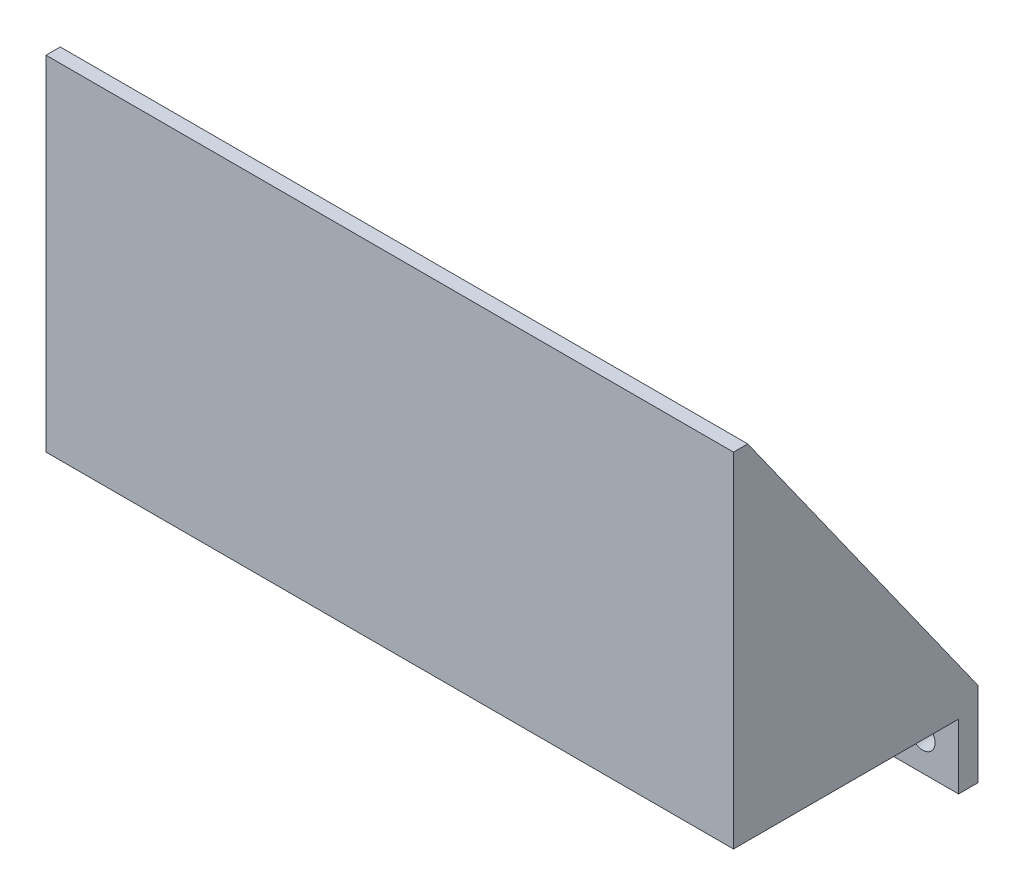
ISO-10303-21;
HEADER;
FILE_DESCRIPTION(('STEP AP214'),'2;1');
FILE_NAME('part.step','',(''),(''),'','','');
FILE_SCHEMA(('AUTOMOTIVE_DESIGN { 1 0 10303 214 1 1 1 1 }'));
ENDSEC;
DATA;
#1=APPLICATION_CONTEXT('core data for automotive mechanical design processes');
#2=APPLICATION_PROTOCOL_DEFINITION('international standard','automotive_design',2000,#1);
#3=PRODUCT_CONTEXT('',#1,'mechanical');
#4=PRODUCT('Part','Part','',(#3));
#5=PRODUCT_RELATED_PRODUCT_CATEGORY('part','',(#4));
#6=PRODUCT_DEFINITION_FORMATION('','',#4);
#7=PRODUCT_DEFINITION_CONTEXT('part definition',#1,'design');
#8=PRODUCT_DEFINITION('design','',#6,#7);
#9=PRODUCT_DEFINITION_SHAPE('','',#8);
#10=(LENGTH_UNIT() NAMED_UNIT(*) SI_UNIT(.MILLI.,.METRE.));
#11=(NAMED_UNIT(*) PLANE_ANGLE_UNIT() SI_UNIT($,.RADIAN.));
#12=(NAMED_UNIT(*) SI_UNIT($,.STERADIAN.) SOLID_ANGLE_UNIT());
#13=UNCERTAINTY_MEASURE_WITH_UNIT(LENGTH_MEASURE(1.E-05),#10,'distance_accuracy_value','');
#14=(GEOMETRIC_REPRESENTATION_CONTEXT(3) GLOBAL_UNCERTAINTY_ASSIGNED_CONTEXT((#13)) GLOBAL_UNIT_ASSIGNED_CONTEXT((#10,
#11,#12)) REPRESENTATION_CONTEXT('',''));
#15=CARTESIAN_POINT('',(0.,0.,0.));
#16=DIRECTION('',(0.,0.,1.));
#17=DIRECTION('',(1.,0.,0.));
#18=AXIS2_PLACEMENT_3D('',#15,#16,#17);
#19=CARTESIAN_POINT('',(-3.,50.,0.));
#20=DIRECTION('',(1.,0.,0.));
#21=DIRECTION('',(0.,0.,-1.));
#22=AXIS2_PLACEMENT_3D('',#19,#20,#21);
#23=PLANE('',#22);
#24=DIRECTION('',(0.,0.815382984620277,0.578921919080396));
#25=VECTOR('',#24,1.);
#26=CARTESIAN_POINT('',(-3.,50.,0.));
#27=LINE('',#26,#25);
#28=CARTESIAN_POINT('',(-3.,0.,-35.5));
#29=VERTEX_POINT('',#28);
#30=CARTESIAN_POINT('',(-3.,50.,0.));
#31=VERTEX_POINT('',#30);
#32=EDGE_CURVE('E80',#29,#31,#27,.T.);
#33=ORIENTED_EDGE('',*,*,#32,.F.);
#34=DIRECTION('',(0.,1.,0.));
#35=VECTOR('',#34,1.);
#36=CARTESIAN_POINT('',(-3.,-13.,-35.5));
#37=LINE('',#36,#35);
#38=CARTESIAN_POINT('',(-3.,-13.,-35.5));
#39=VERTEX_POINT('',#38);
#40=EDGE_CURVE('E125',#39,#29,#37,.T.);
#41=ORIENTED_EDGE('',*,*,#40,.F.);
#42=DIRECTION('',(0.,0.,1.));
#43=VECTOR('',#42,1.);
#44=CARTESIAN_POINT('',(-3.,-13.,0.));
#45=LINE('',#44,#43);
#46=CARTESIAN_POINT('',(-3.,-13.,-32.5));
#47=VERTEX_POINT('',#46);
#48=EDGE_CURVE('E129',#39,#47,#45,.T.);
#49=ORIENTED_EDGE('',*,*,#48,.T.);
#50=DIRECTION('',(0.,1.,0.));
#51=VECTOR('',#50,1.);
#52=CARTESIAN_POINT('',(-3.,-13.,-32.5));
#53=LINE('',#52,#51);
#54=CARTESIAN_POINT('',(-3.,-3.,-32.5));
#55=VERTEX_POINT('',#54);
#56=EDGE_CURVE('E133',#47,#55,#53,.T.);
#57=ORIENTED_EDGE('',*,*,#56,.T.);
#58=DIRECTION('',(0.,0.,1.));
#59=VECTOR('',#58,1.);
#60=CARTESIAN_POINT('',(-3.,-3.,0.));
#61=LINE('',#60,#59);
#62=CARTESIAN_POINT('',(-3.,-3.,2.19738026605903));
#63=VERTEX_POINT('',#62);
#64=EDGE_CURVE('E164',#55,#63,#61,.T.);
#65=ORIENTED_EDGE('',*,*,#64,.T.);
#66=DIRECTION('',(0.,-1.,0.));
#67=VECTOR('',#66,1.);
#68=CARTESIAN_POINT('',(-3.,50.,2.19738026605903));
#69=LINE('',#68,#67);
#70=CARTESIAN_POINT('',(-3.,50.,2.19738026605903));
#71=VERTEX_POINT('',#70);
#72=EDGE_CURVE('E11',#71,#63,#69,.T.);
#73=ORIENTED_EDGE('',*,*,#72,.F.);
#74=DIRECTION('',(0.,0.,1.));
#75=VECTOR('',#74,1.);
#76=CARTESIAN_POINT('',(-3.,50.,0.));
#77=LINE('',#76,#75);
#78=EDGE_CURVE('E185',#31,#71,#77,.T.);
#79=ORIENTED_EDGE('',*,*,#78,.F.);
#80=EDGE_LOOP('',(#33,#41,#49,#57,#65,#73,#79));
#81=FACE_BOUND('',#80,.T.);
#82=ADVANCED_FACE('F41',(#81),#23,.F.);
#83=CARTESIAN_POINT('',(103.,50.,0.));
#84=DIRECTION('',(1.,0.,0.));
#85=DIRECTION('',(0.,0.,-1.));
#86=AXIS2_PLACEMENT_3D('',#83,#84,#85);
#87=PLANE('',#86);
#88=DIRECTION('',(0.,1.,0.));
#89=VECTOR('',#88,1.);
#90=CARTESIAN_POINT('',(103.,-13.,-35.5));
#91=LINE('',#90,#89);
#92=CARTESIAN_POINT('',(103.,-13.,-35.5));
#93=VERTEX_POINT('',#92);
#94=CARTESIAN_POINT('',(103.,0.,-35.5));
#95=VERTEX_POINT('',#94);
#96=EDGE_CURVE('E141',#93,#95,#91,.T.);
#97=ORIENTED_EDGE('',*,*,#96,.T.);
#98=DIRECTION('',(0.,0.815382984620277,0.578921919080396));
#99=VECTOR('',#98,1.);
#100=CARTESIAN_POINT('',(103.,50.,0.));
#101=LINE('',#100,#99);
#102=CARTESIAN_POINT('',(103.,50.,0.));
#103=VERTEX_POINT('',#102);
#104=EDGE_CURVE('E182',#95,#103,#101,.T.);
#105=ORIENTED_EDGE('',*,*,#104,.T.);
#106=DIRECTION('',(0.,0.,1.));
#107=VECTOR('',#106,1.);
#108=CARTESIAN_POINT('',(103.,50.,0.));
#109=LINE('',#108,#107);
#110=CARTESIAN_POINT('',(103.,50.,2.19738026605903));
#111=VERTEX_POINT('',#110);
#112=EDGE_CURVE('E59',#103,#111,#109,.T.);
#113=ORIENTED_EDGE('',*,*,#112,.T.);
#114=DIRECTION('',(0.,-1.,0.));
#115=VECTOR('',#114,1.);
#116=CARTESIAN_POINT('',(103.,50.,2.19738026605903));
#117=LINE('',#116,#115);
#118=CARTESIAN_POINT('',(103.,-3.,2.19738026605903));
#119=VERTEX_POINT('',#118);
#120=EDGE_CURVE('E50',#111,#119,#117,.T.);
#121=ORIENTED_EDGE('',*,*,#120,.T.);
#122=DIRECTION('',(0.,0.,1.));
#123=VECTOR('',#122,1.);
#124=CARTESIAN_POINT('',(103.,-3.,0.));
#125=LINE('',#124,#123);
#126=CARTESIAN_POINT('',(103.,-3.,-32.5));
#127=VERTEX_POINT('',#126);
#128=EDGE_CURVE('E170',#127,#119,#125,.T.);
#129=ORIENTED_EDGE('',*,*,#128,.F.);
#130=DIRECTION('',(0.,1.,0.));
#131=VECTOR('',#130,1.);
#132=CARTESIAN_POINT('',(103.,-13.,-32.5));
#133=LINE('',#132,#131);
#134=CARTESIAN_POINT('',(103.,-13.,-32.5));
#135=VERTEX_POINT('',#134);
#136=EDGE_CURVE('E159',#135,#127,#133,.T.);
#137=ORIENTED_EDGE('',*,*,#136,.F.);
#138=DIRECTION('',(0.,0.,1.));
#139=VECTOR('',#138,1.);
#140=CARTESIAN_POINT('',(103.,-13.,0.));
#141=LINE('',#140,#139);
#142=EDGE_CURVE('E134',#93,#135,#141,.T.);
#143=ORIENTED_EDGE('',*,*,#142,.F.);
#144=EDGE_LOOP('',(#97,#105,#113,#121,#129,#137,#143));
#145=FACE_BOUND('',#144,.T.);
#146=ADVANCED_FACE('F207',(#145),#87,.T.);
#147=CARTESIAN_POINT('',(100.5,50.,0.));
#148=DIRECTION('',(-1.,0.,0.));
#149=DIRECTION('',(0.,0.,1.));
#150=AXIS2_PLACEMENT_3D('',#147,#148,#149);
#151=PLANE('',#150);
#152=DIRECTION('',(0.,-1.,0.));
#153=VECTOR('',#152,1.);
#154=CARTESIAN_POINT('',(100.5,50.,0.));
#155=LINE('',#154,#153);
#156=CARTESIAN_POINT('',(100.5,50.,0.));
#157=VERTEX_POINT('',#156);
#158=CARTESIAN_POINT('',(100.5,0.,0.));
#159=VERTEX_POINT('',#158);
#160=EDGE_CURVE('E71',#157,#159,#155,.T.);
#161=ORIENTED_EDGE('',*,*,#160,.F.);
#162=DIRECTION('',(0.,-0.815382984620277,-0.578921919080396));
#163=VECTOR('',#162,1.);
#164=CARTESIAN_POINT('',(100.5,50.,0.));
#165=LINE('',#164,#163);
#166=CARTESIAN_POINT('',(100.5,0.,-35.5));
#167=VERTEX_POINT('',#166);
#168=EDGE_CURVE('E179',#157,#167,#165,.T.);
#169=ORIENTED_EDGE('',*,*,#168,.T.);
#170=DIRECTION('',(0.,0.,-1.));
#171=VECTOR('',#170,1.);
#172=CARTESIAN_POINT('',(100.5,0.,0.));
#173=LINE('',#172,#171);
#174=EDGE_CURVE('E194',#159,#167,#173,.T.);
#175=ORIENTED_EDGE('',*,*,#174,.F.);
#176=EDGE_LOOP('',(#161,#169,#175));
#177=FACE_BOUND('',#176,.T.);
#178=ADVANCED_FACE('F215',(#177),#151,.T.);
#179=CARTESIAN_POINT('',(0.,50.,0.));
#180=DIRECTION('',(-1.,0.,0.));
#181=DIRECTION('',(0.,0.,1.));
#182=AXIS2_PLACEMENT_3D('',#179,#180,#181);
#183=PLANE('',#182);
#184=DIRECTION('',(0.,-0.815382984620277,-0.578921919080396));
#185=VECTOR('',#184,1.);
#186=CARTESIAN_POINT('',(0.,50.,0.));
#187=LINE('',#186,#185);
#188=CARTESIAN_POINT('',(0.,50.,0.));
#189=VERTEX_POINT('',#188);
#190=CARTESIAN_POINT('',(0.,0.,-35.5));
#191=VERTEX_POINT('',#190);
#192=EDGE_CURVE('E176',#189,#191,#187,.T.);
#193=ORIENTED_EDGE('',*,*,#192,.F.);
#194=DIRECTION('',(0.,-1.,0.));
#195=VECTOR('',#194,1.);
#196=CARTESIAN_POINT('',(0.,50.,0.));
#197=LINE('',#196,#195);
#198=CARTESIAN_POINT('',(0.,0.,0.));
#199=VERTEX_POINT('',#198);
#200=EDGE_CURVE('E193',#189,#199,#197,.T.);
#201=ORIENTED_EDGE('',*,*,#200,.T.);
#202=DIRECTION('',(0.,0.,-1.));
#203=VECTOR('',#202,1.);
#204=CARTESIAN_POINT('',(0.,0.,0.));
#205=LINE('',#204,#203);
#206=EDGE_CURVE('E188',#199,#191,#205,.T.);
#207=ORIENTED_EDGE('',*,*,#206,.T.);
#208=EDGE_LOOP('',(#193,#201,#207));
#209=FACE_BOUND('',#208,.T.);
#210=ADVANCED_FACE('F221',(#209),#183,.F.);
#211=CARTESIAN_POINT('',(0.,50.,0.));
#212=DIRECTION('',(0.,1.,0.));
#213=DIRECTION('',(0.,0.,1.));
#214=AXIS2_PLACEMENT_3D('',#211,#212,#213);
#215=PLANE('',#214);
#216=ORIENTED_EDGE('',*,*,#112,.F.);
#217=DIRECTION('',(-1.,0.,0.));
#218=VECTOR('',#217,1.);
#219=CARTESIAN_POINT('',(110.,50.,0.));
#220=LINE('',#219,#218);
#221=EDGE_CURVE('E175',#103,#157,#220,.T.);
#222=ORIENTED_EDGE('',*,*,#221,.T.);
#223=DIRECTION('',(1.,0.,0.));
#224=VECTOR('',#223,1.);
#225=CARTESIAN_POINT('',(0.,50.,0.));
#226=LINE('',#225,#224);
#227=EDGE_CURVE('E191',#189,#157,#226,.T.);
#228=ORIENTED_EDGE('',*,*,#227,.F.);
#229=EDGE_CURVE('E173',#189,#31,#220,.T.);
#230=ORIENTED_EDGE('',*,*,#229,.T.);
#231=ORIENTED_EDGE('',*,*,#78,.T.);
#232=DIRECTION('',(1.,0.,0.));
#233=VECTOR('',#232,1.);
#234=CARTESIAN_POINT('',(0.,50.,2.19738026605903));
#235=LINE('',#234,#233);
#236=EDGE_CURVE('E187',#71,#111,#235,.T.);
#237=ORIENTED_EDGE('',*,*,#236,.T.);
#238=EDGE_LOOP('',(#216,#222,#228,#230,#231,#237));
#239=FACE_BOUND('',#238,.T.);
#240=ADVANCED_FACE('F213',(#239),#215,.T.);
#241=CARTESIAN_POINT('',(0.,50.,2.19738026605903));
#242=DIRECTION('',(0.,0.,-1.));
#243=DIRECTION('',(-1.,0.,0.));
#244=AXIS2_PLACEMENT_3D('',#241,#242,#243);
#245=PLANE('',#244);
#246=ORIENTED_EDGE('',*,*,#72,.T.);
#247=DIRECTION('',(1.,0.,0.));
#248=VECTOR('',#247,1.);
#249=CARTESIAN_POINT('',(0.,-3.,2.19738026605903));
#250=LINE('',#249,#248);
#251=EDGE_CURVE('E167',#63,#119,#250,.T.);
#252=ORIENTED_EDGE('',*,*,#251,.T.);
#253=ORIENTED_EDGE('',*,*,#120,.F.);
#254=ORIENTED_EDGE('',*,*,#236,.F.);
#255=EDGE_LOOP('',(#246,#252,#253,#254));
#256=FACE_BOUND('',#255,.T.);
#257=ADVANCED_FACE('F229',(#256),#245,.F.);
#258=CARTESIAN_POINT('',(0.,50.,0.));
#259=DIRECTION('',(0.,0.,-1.));
#260=DIRECTION('',(-1.,0.,0.));
#261=AXIS2_PLACEMENT_3D('',#258,#259,#260);
#262=PLANE('',#261);
#263=DIRECTION('',(1.,0.,0.));
#264=VECTOR('',#263,1.);
#265=CARTESIAN_POINT('',(0.,0.,0.));
#266=LINE('',#265,#264);
#267=EDGE_CURVE('E196',#199,#159,#266,.T.);
#268=ORIENTED_EDGE('',*,*,#267,.F.);
#269=ORIENTED_EDGE('',*,*,#200,.F.);
#270=ORIENTED_EDGE('',*,*,#227,.T.);
#271=ORIENTED_EDGE('',*,*,#160,.T.);
#272=EDGE_LOOP('',(#268,#269,#270,#271));
#273=FACE_BOUND('',#272,.T.);
#274=ADVANCED_FACE('F217',(#273),#262,.T.);
#275=CARTESIAN_POINT('',(110.,0.,-35.5));
#276=DIRECTION('',(0.,0.578921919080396,-0.815382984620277));
#277=DIRECTION('',(0.,0.815382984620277,0.578921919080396));
#278=AXIS2_PLACEMENT_3D('',#275,#276,#277);
#279=PLANE('',#278);
#280=ORIENTED_EDGE('',*,*,#32,.T.);
#281=ORIENTED_EDGE('',*,*,#229,.F.);
#282=ORIENTED_EDGE('',*,*,#192,.T.);
#283=DIRECTION('',(-1.,0.,0.));
#284=VECTOR('',#283,1.);
#285=CARTESIAN_POINT('',(0.,0.,-35.5));
#286=LINE('',#285,#284);
#287=EDGE_CURVE('E197',#191,#29,#286,.T.);
#288=ORIENTED_EDGE('',*,*,#287,.T.);
#289=EDGE_LOOP('',(#280,#281,#282,#288));
#290=FACE_BOUND('',#289,.T.);
#291=ADVANCED_FACE('F222',(#290),#279,.T.);
#292=DIRECTION('',(1.,0.,0.));
#293=VECTOR('',#292,1.);
#294=CARTESIAN_POINT('',(100.5,0.,-35.5));
#295=LINE('',#294,#293);
#296=EDGE_CURVE('E44',#167,#95,#295,.T.);
#297=ORIENTED_EDGE('',*,*,#296,.F.);
#298=ORIENTED_EDGE('',*,*,#168,.F.);
#299=ORIENTED_EDGE('',*,*,#221,.F.);
#300=ORIENTED_EDGE('',*,*,#104,.F.);
#301=EDGE_LOOP('',(#297,#298,#299,#300));
#302=FACE_BOUND('',#301,.T.);
#303=ADVANCED_FACE('F209',(#302),#279,.T.);
#304=CARTESIAN_POINT('',(0.,0.,0.));
#305=DIRECTION('',(0.,1.,0.));
#306=DIRECTION('',(0.,0.,1.));
#307=AXIS2_PLACEMENT_3D('',#304,#305,#306);
#308=PLANE('',#307);
#309=ORIENTED_EDGE('',*,*,#206,.F.);
#310=ORIENTED_EDGE('',*,*,#267,.T.);
#311=ORIENTED_EDGE('',*,*,#174,.T.);
#312=DIRECTION('',(1.,0.,0.));
#313=VECTOR('',#312,1.);
#314=CARTESIAN_POINT('',(0.,0.,-35.5));
#315=LINE('',#314,#313);
#316=EDGE_CURVE('E143',#191,#167,#315,.T.);
#317=ORIENTED_EDGE('',*,*,#316,.F.);
#318=EDGE_LOOP('',(#309,#310,#311,#317));
#319=FACE_BOUND('',#318,.T.);
#320=ADVANCED_FACE('F244',(#319),#308,.T.);
#321=CARTESIAN_POINT('',(0.,-3.,0.));
#322=DIRECTION('',(0.,1.,0.));
#323=DIRECTION('',(0.,0.,1.));
#324=AXIS2_PLACEMENT_3D('',#321,#322,#323);
#325=PLANE('',#324);
#326=DIRECTION('',(1.,0.,0.));
#327=VECTOR('',#326,1.);
#328=CARTESIAN_POINT('',(0.,-3.,-32.5));
#329=LINE('',#328,#327);
#330=EDGE_CURVE('E158',#55,#127,#329,.T.);
#331=ORIENTED_EDGE('',*,*,#330,.T.);
#332=ORIENTED_EDGE('',*,*,#128,.T.);
#333=ORIENTED_EDGE('',*,*,#251,.F.);
#334=ORIENTED_EDGE('',*,*,#64,.F.);
#335=EDGE_LOOP('',(#331,#332,#333,#334));
#336=FACE_BOUND('',#335,.T.);
#337=ADVANCED_FACE('F232',(#336),#325,.F.);
#338=CARTESIAN_POINT('',(0.,-13.,-32.5));
#339=DIRECTION('',(0.,0.,1.));
#340=DIRECTION('',(1.,0.,0.));
#341=AXIS2_PLACEMENT_3D('',#338,#339,#340);
#342=PLANE('',#341);
#343=CARTESIAN_POINT('',(2.51427855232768,-8.,-32.5));
#344=DIRECTION('',(0.,0.,1.));
#345=DIRECTION('',(1.,0.,0.));
#346=AXIS2_PLACEMENT_3D('',#343,#344,#345);
#347=CIRCLE('',#346,1.9);
#348=CARTESIAN_POINT('',(4.41427855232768,-8.,-32.5));
#349=VERTEX_POINT('',#348);
#350=EDGE_CURVE('E496',#349,#349,#347,.T.);
#351=ORIENTED_EDGE('',*,*,#350,.F.);
#352=EDGE_LOOP('',(#351));
#353=FACE_BOUND('',#352,.T.);
#354=CARTESIAN_POINT('',(97.4857214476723,-8.,-32.5));
#355=DIRECTION('',(0.,0.,1.));
#356=DIRECTION('',(-1.,0.,0.));
#357=AXIS2_PLACEMENT_3D('',#354,#355,#356);
#358=CIRCLE('',#357,1.9);
#359=CARTESIAN_POINT('',(95.5857214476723,-8.,-32.5));
#360=VERTEX_POINT('',#359);
#361=EDGE_CURVE('E497',#360,#360,#358,.T.);
#362=ORIENTED_EDGE('',*,*,#361,.F.);
#363=EDGE_LOOP('',(#362));
#364=FACE_BOUND('',#363,.T.);
#365=ORIENTED_EDGE('',*,*,#330,.F.);
#366=ORIENTED_EDGE('',*,*,#56,.F.);
#367=DIRECTION('',(1.,0.,0.));
#368=VECTOR('',#367,1.);
#369=CARTESIAN_POINT('',(0.,-13.,-32.5));
#370=LINE('',#369,#368);
#371=EDGE_CURVE('E148',#47,#135,#370,.T.);
#372=ORIENTED_EDGE('',*,*,#371,.T.);
#373=ORIENTED_EDGE('',*,*,#136,.T.);
#374=EDGE_LOOP('',(#365,#366,#372,#373));
#375=FACE_BOUND('',#374,.T.);
#376=ADVANCED_FACE('F234',(#353,#364,#375),#342,.T.);
#377=CARTESIAN_POINT('',(0.,-13.,-35.5));
#378=DIRECTION('',(0.,0.,1.));
#379=DIRECTION('',(1.,0.,0.));
#380=AXIS2_PLACEMENT_3D('',#377,#378,#379);
#381=PLANE('',#380);
#382=CARTESIAN_POINT('',(2.51427855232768,-8.,-35.5));
#383=DIRECTION('',(0.,0.,1.));
#384=DIRECTION('',(1.,0.,0.));
#385=AXIS2_PLACEMENT_3D('',#382,#383,#384);
#386=CIRCLE('',#385,1.9);
#387=CARTESIAN_POINT('',(4.41427855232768,-8.,-35.5));
#388=VERTEX_POINT('',#387);
#389=EDGE_CURVE('E156',#388,#388,#386,.F.);
#390=ORIENTED_EDGE('',*,*,#389,.F.);
#391=EDGE_LOOP('',(#390));
#392=FACE_BOUND('',#391,.T.);
#393=CARTESIAN_POINT('',(97.4857214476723,-8.,-35.5));
#394=DIRECTION('',(0.,0.,1.));
#395=DIRECTION('',(1.,0.,0.));
#396=AXIS2_PLACEMENT_3D('',#393,#394,#395);
#397=CIRCLE('',#396,1.9);
#398=CARTESIAN_POINT('',(99.3857214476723,-8.,-35.5));
#399=VERTEX_POINT('',#398);
#400=EDGE_CURVE('E501',#399,#399,#397,.F.);
#401=ORIENTED_EDGE('',*,*,#400,.F.);
#402=EDGE_LOOP('',(#401));
#403=FACE_BOUND('',#402,.T.);
#404=ORIENTED_EDGE('',*,*,#287,.F.);
#405=ORIENTED_EDGE('',*,*,#316,.T.);
#406=ORIENTED_EDGE('',*,*,#296,.T.);
#407=ORIENTED_EDGE('',*,*,#96,.F.);
#408=DIRECTION('',(1.,0.,0.));
#409=VECTOR('',#408,1.);
#410=CARTESIAN_POINT('',(0.,-13.,-35.5));
#411=LINE('',#410,#409);
#412=EDGE_CURVE('E138',#39,#93,#411,.T.);
#413=ORIENTED_EDGE('',*,*,#412,.F.);
#414=ORIENTED_EDGE('',*,*,#40,.T.);
#415=EDGE_LOOP('',(#404,#405,#406,#407,#413,#414));
#416=FACE_BOUND('',#415,.T.);
#417=ADVANCED_FACE('F139',(#392,#403,#416),#381,.F.);
#418=CARTESIAN_POINT('',(0.,-13.,0.));
#419=DIRECTION('',(0.,1.,0.));
#420=DIRECTION('',(0.,0.,1.));
#421=AXIS2_PLACEMENT_3D('',#418,#419,#420);
#422=PLANE('',#421);
#423=ORIENTED_EDGE('',*,*,#412,.T.);
#424=ORIENTED_EDGE('',*,*,#142,.T.);
#425=ORIENTED_EDGE('',*,*,#371,.F.);
#426=ORIENTED_EDGE('',*,*,#48,.F.);
#427=EDGE_LOOP('',(#423,#424,#425,#426));
#428=FACE_BOUND('',#427,.T.);
#429=ADVANCED_FACE('F146',(#428),#422,.F.);
#430=CARTESIAN_POINT('',(97.4857214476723,-8.,-40.8740115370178));
#431=DIRECTION('',(0.,0.,1.));
#432=DIRECTION('',(1.,0.,0.));
#433=AXIS2_PLACEMENT_3D('',#430,#431,#432);
#434=CYLINDRICAL_SURFACE('',#433,1.9);
#435=ORIENTED_EDGE('',*,*,#400,.T.);
#436=EDGE_LOOP('',(#435));
#437=FACE_BOUND('',#436,.T.);
#438=ORIENTED_EDGE('',*,*,#361,.T.);
#439=EDGE_LOOP('',(#438));
#440=FACE_BOUND('',#439,.T.);
#441=ADVANCED_FACE('F293',(#437,#440),#434,.F.);
#442=CARTESIAN_POINT('',(2.51427855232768,-8.,-40.8740115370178));
#443=DIRECTION('',(0.,0.,1.));
#444=DIRECTION('',(1.,0.,0.));
#445=AXIS2_PLACEMENT_3D('',#442,#443,#444);
#446=CYLINDRICAL_SURFACE('',#445,1.9);
#447=ORIENTED_EDGE('',*,*,#389,.T.);
#448=EDGE_LOOP('',(#447));
#449=FACE_BOUND('',#448,.T.);
#450=ORIENTED_EDGE('',*,*,#350,.T.);
#451=EDGE_LOOP('',(#450));
#452=FACE_BOUND('',#451,.T.);
#453=ADVANCED_FACE('F315',(#449,#452),#446,.F.);
#454=CLOSED_SHELL('',(#82,#146,#178,#210,#240,#257,#274,#291,#303,#320,#337,#376,#417,#429,#441,#453));
#455=MANIFOLD_SOLID_BREP('B2',#454);
#456=ADVANCED_BREP_SHAPE_REPRESENTATION('',(#18,#455),#14);
#457=SHAPE_DEFINITION_REPRESENTATION(#9,#456);
ENDSEC;
END-ISO-10303-21;
